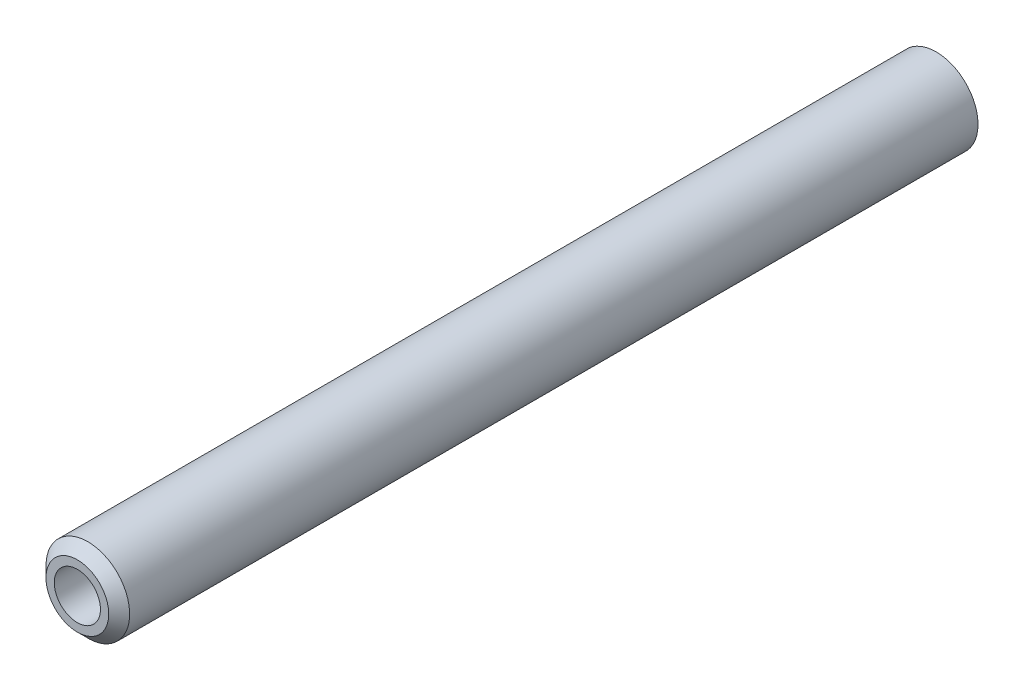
from build123d import *

# Parameters (mm, degrees)
SKETCH3_R           = 1.5875
SKETCH3_R_2         = 0.8763
BOSS_EXTRUDE1_DEPTH = 16.3
CHAMFER1_SIZE       = 0.396875


with BuildPart() as part:
    # Sketch3 → Boss-Extrude1 (new, symmetric)
    with BuildSketch(Plane.XY):
        Circle(SKETCH3_R)
        Circle(SKETCH3_R_2, mode=Mode.SUBTRACT)
    extrude(amount=BOSS_EXTRUDE1_DEPTH, both=True)

    # Chamfer1
    chamfer1_edges = [part.edges().sort_by_distance(p)[0] for p in [
        (-1.5875, 0, 16.3),
    ]]
    chamfer(chamfer1_edges, length=CHAMFER1_SIZE)


solid = part.part
